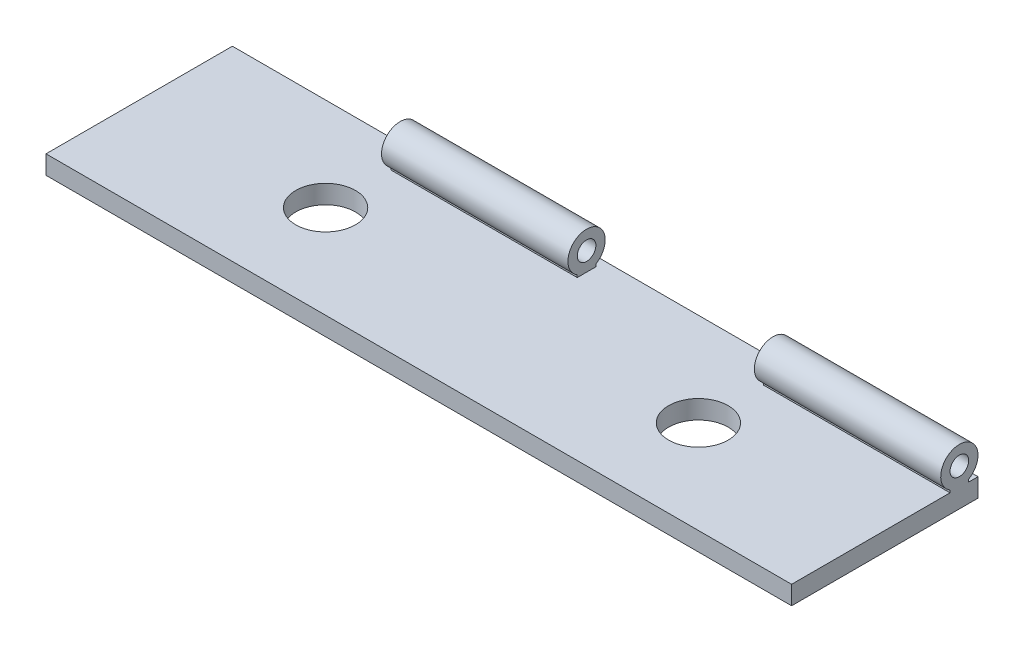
ISO-10303-21;
HEADER;
FILE_DESCRIPTION(('STEP AP214'),'2;1');
FILE_NAME('part.step','',(''),(''),'','','');
FILE_SCHEMA(('AUTOMOTIVE_DESIGN { 1 0 10303 214 1 1 1 1 }'));
ENDSEC;
DATA;
#1=APPLICATION_CONTEXT('core data for automotive mechanical design processes');
#2=APPLICATION_PROTOCOL_DEFINITION('international standard','automotive_design',2000,#1);
#3=PRODUCT_CONTEXT('',#1,'mechanical');
#4=PRODUCT('Part','Part','',(#3));
#5=PRODUCT_RELATED_PRODUCT_CATEGORY('part','',(#4));
#6=PRODUCT_DEFINITION_FORMATION('','',#4);
#7=PRODUCT_DEFINITION_CONTEXT('part definition',#1,'design');
#8=PRODUCT_DEFINITION('design','',#6,#7);
#9=PRODUCT_DEFINITION_SHAPE('','',#8);
#10=(LENGTH_UNIT() NAMED_UNIT(*) SI_UNIT(.MILLI.,.METRE.));
#11=(NAMED_UNIT(*) PLANE_ANGLE_UNIT() SI_UNIT($,.RADIAN.));
#12=(NAMED_UNIT(*) SI_UNIT($,.STERADIAN.) SOLID_ANGLE_UNIT());
#13=UNCERTAINTY_MEASURE_WITH_UNIT(LENGTH_MEASURE(1.E-05),#10,'distance_accuracy_value','');
#14=(GEOMETRIC_REPRESENTATION_CONTEXT(3) GLOBAL_UNCERTAINTY_ASSIGNED_CONTEXT((#13)) GLOBAL_UNIT_ASSIGNED_CONTEXT((#10,
#11,#12)) REPRESENTATION_CONTEXT('',''));
#15=CARTESIAN_POINT('',(0.,0.,0.));
#16=DIRECTION('',(0.,0.,1.));
#17=DIRECTION('',(1.,0.,0.));
#18=AXIS2_PLACEMENT_3D('',#15,#16,#17);
#19=CARTESIAN_POINT('',(0.,2.,-9.));
#20=DIRECTION('',(1.,0.,0.));
#21=DIRECTION('',(0.,0.,-1.));
#22=AXIS2_PLACEMENT_3D('',#19,#20,#21);
#23=CYLINDRICAL_SURFACE('',#22,0.999999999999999);
#24=DIRECTION('',(1.,0.,0.));
#25=VECTOR('',#24,1.);
#26=CARTESIAN_POINT('',(0.,1.13397459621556,-8.5));
#27=LINE('',#26,#25);
#28=CARTESIAN_POINT('',(10.,1.13397459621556,-8.5));
#29=VERTEX_POINT('',#28);
#30=CARTESIAN_POINT('',(20.,1.13397459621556,-8.5));
#31=VERTEX_POINT('',#30);
#32=EDGE_CURVE('E158',#29,#31,#27,.T.);
#33=ORIENTED_EDGE('',*,*,#32,.T.);
#34=CARTESIAN_POINT('',(20.,2.,-9.));
#35=DIRECTION('',(1.,0.,0.));
#36=DIRECTION('',(0.,0.,-1.));
#37=AXIS2_PLACEMENT_3D('',#34,#35,#36);
#38=CIRCLE('',#37,0.999999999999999);
#39=CARTESIAN_POINT('',(20.,1.13397459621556,-9.5));
#40=VERTEX_POINT('',#39);
#41=EDGE_CURVE('E140',#31,#40,#38,.F.);
#42=ORIENTED_EDGE('',*,*,#41,.T.);
#43=DIRECTION('',(1.,0.,0.));
#44=VECTOR('',#43,1.);
#45=CARTESIAN_POINT('',(0.,1.13397459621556,-9.5));
#46=LINE('',#45,#44);
#47=CARTESIAN_POINT('',(10.,1.13397459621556,-9.5));
#48=VERTEX_POINT('',#47);
#49=EDGE_CURVE('E138',#48,#40,#46,.T.);
#50=ORIENTED_EDGE('',*,*,#49,.F.);
#51=CARTESIAN_POINT('',(10.,2.,-9.));
#52=DIRECTION('',(-1.,0.,0.));
#53=DIRECTION('',(0.,0.,1.));
#54=AXIS2_PLACEMENT_3D('',#51,#52,#53);
#55=CIRCLE('',#54,0.999999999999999);
#56=EDGE_CURVE('E252',#48,#29,#55,.F.);
#57=ORIENTED_EDGE('',*,*,#56,.T.);
#58=EDGE_LOOP('',(#33,#42,#50,#57));
#59=FACE_BOUND('',#58,.T.);
#60=ADVANCED_FACE('F30',(#59),#23,.T.);
#61=CARTESIAN_POINT('',(30.,1.13397459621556,-9.5));
#62=VERTEX_POINT('',#61);
#63=CARTESIAN_POINT('',(40.,1.13397459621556,-9.5));
#64=VERTEX_POINT('',#63);
#65=EDGE_CURVE('E145',#62,#64,#46,.T.);
#66=ORIENTED_EDGE('',*,*,#65,.F.);
#67=CARTESIAN_POINT('',(30.,2.,-9.));
#68=DIRECTION('',(-1.,0.,0.));
#69=DIRECTION('',(0.,0.,1.));
#70=AXIS2_PLACEMENT_3D('',#67,#68,#69);
#71=CIRCLE('',#70,0.999999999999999);
#72=CARTESIAN_POINT('',(30.,1.13397459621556,-8.5));
#73=VERTEX_POINT('',#72);
#74=EDGE_CURVE('E325',#62,#73,#71,.F.);
#75=ORIENTED_EDGE('',*,*,#74,.T.);
#76=CARTESIAN_POINT('',(40.,1.13397459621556,-8.5));
#77=VERTEX_POINT('',#76);
#78=EDGE_CURVE('E162',#73,#77,#27,.T.);
#79=ORIENTED_EDGE('',*,*,#78,.T.);
#80=CARTESIAN_POINT('',(40.,2.,-9.));
#81=DIRECTION('',(1.,0.,0.));
#82=DIRECTION('',(0.,0.,-1.));
#83=AXIS2_PLACEMENT_3D('',#80,#81,#82);
#84=CIRCLE('',#83,0.999999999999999);
#85=EDGE_CURVE('E238',#64,#77,#84,.T.);
#86=ORIENTED_EDGE('',*,*,#85,.F.);
#87=EDGE_LOOP('',(#66,#75,#79,#86));
#88=FACE_BOUND('',#87,.T.);
#89=ADVANCED_FACE('F276',(#88),#23,.T.);
#90=CARTESIAN_POINT('',(0.,0.999999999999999,-9.5));
#91=DIRECTION('',(0.,0.,-1.));
#92=DIRECTION('',(-1.,0.,0.));
#93=AXIS2_PLACEMENT_3D('',#90,#91,#92);
#94=PLANE('',#93);
#95=ORIENTED_EDGE('',*,*,#49,.T.);
#96=DIRECTION('',(0.,-1.,0.));
#97=VECTOR('',#96,1.);
#98=CARTESIAN_POINT('',(20.,0.999999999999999,-9.5));
#99=LINE('',#98,#97);
#100=CARTESIAN_POINT('',(20.,1.,-9.5));
#101=VERTEX_POINT('',#100);
#102=EDGE_CURVE('E124',#40,#101,#99,.T.);
#103=ORIENTED_EDGE('',*,*,#102,.T.);
#104=DIRECTION('',(1.,0.,0.));
#105=VECTOR('',#104,1.);
#106=CARTESIAN_POINT('',(0.,0.999999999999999,-9.5));
#107=LINE('',#106,#105);
#108=CARTESIAN_POINT('',(10.,1.,-9.5));
#109=VERTEX_POINT('',#108);
#110=EDGE_CURVE('E136',#109,#101,#107,.T.);
#111=ORIENTED_EDGE('',*,*,#110,.F.);
#112=DIRECTION('',(0.,1.,0.));
#113=VECTOR('',#112,1.);
#114=CARTESIAN_POINT('',(10.,0.999999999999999,-9.5));
#115=LINE('',#114,#113);
#116=EDGE_CURVE('E259',#109,#48,#115,.T.);
#117=ORIENTED_EDGE('',*,*,#116,.T.);
#118=EDGE_LOOP('',(#95,#103,#111,#117));
#119=FACE_BOUND('',#118,.T.);
#120=ADVANCED_FACE('F134',(#119),#94,.T.);
#121=CARTESIAN_POINT('',(30.,1.,-9.5));
#122=VERTEX_POINT('',#121);
#123=CARTESIAN_POINT('',(40.,1.,-9.5));
#124=VERTEX_POINT('',#123);
#125=EDGE_CURVE('E34',#122,#124,#107,.T.);
#126=ORIENTED_EDGE('',*,*,#125,.F.);
#127=DIRECTION('',(0.,1.,0.));
#128=VECTOR('',#127,1.);
#129=CARTESIAN_POINT('',(30.,0.999999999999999,-9.5));
#130=LINE('',#129,#128);
#131=EDGE_CURVE('E321',#122,#62,#130,.T.);
#132=ORIENTED_EDGE('',*,*,#131,.T.);
#133=ORIENTED_EDGE('',*,*,#65,.T.);
#134=DIRECTION('',(0.,1.,0.));
#135=VECTOR('',#134,1.);
#136=CARTESIAN_POINT('',(40.,0.999999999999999,-9.5));
#137=LINE('',#136,#135);
#138=EDGE_CURVE('E236',#124,#64,#137,.T.);
#139=ORIENTED_EDGE('',*,*,#138,.F.);
#140=EDGE_LOOP('',(#126,#132,#133,#139));
#141=FACE_BOUND('',#140,.T.);
#142=ADVANCED_FACE('F312',(#141),#94,.T.);
#143=CARTESIAN_POINT('',(0.,0.999999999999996,-8.5));
#144=DIRECTION('',(0.,0.,1.));
#145=DIRECTION('',(1.,0.,0.));
#146=AXIS2_PLACEMENT_3D('',#143,#144,#145);
#147=PLANE('',#146);
#148=DIRECTION('',(1.,0.,0.));
#149=VECTOR('',#148,1.);
#150=CARTESIAN_POINT('',(0.,0.999999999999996,-8.5));
#151=LINE('',#150,#149);
#152=CARTESIAN_POINT('',(10.,1.,-8.5));
#153=VERTEX_POINT('',#152);
#154=CARTESIAN_POINT('',(20.,0.999999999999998,-8.5));
#155=VERTEX_POINT('',#154);
#156=EDGE_CURVE('E148',#153,#155,#151,.T.);
#157=ORIENTED_EDGE('',*,*,#156,.T.);
#158=DIRECTION('',(0.,1.,0.));
#159=VECTOR('',#158,1.);
#160=CARTESIAN_POINT('',(20.,0.999999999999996,-8.5));
#161=LINE('',#160,#159);
#162=EDGE_CURVE('E127',#155,#31,#161,.T.);
#163=ORIENTED_EDGE('',*,*,#162,.T.);
#164=ORIENTED_EDGE('',*,*,#32,.F.);
#165=DIRECTION('',(0.,-1.,0.));
#166=VECTOR('',#165,1.);
#167=CARTESIAN_POINT('',(10.,0.999999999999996,-8.5));
#168=LINE('',#167,#166);
#169=EDGE_CURVE('E248',#29,#153,#168,.T.);
#170=ORIENTED_EDGE('',*,*,#169,.T.);
#171=EDGE_LOOP('',(#157,#163,#164,#170));
#172=FACE_BOUND('',#171,.T.);
#173=ADVANCED_FACE('F285',(#172),#147,.T.);
#174=ORIENTED_EDGE('',*,*,#78,.F.);
#175=DIRECTION('',(0.,-1.,0.));
#176=VECTOR('',#175,1.);
#177=CARTESIAN_POINT('',(30.,0.999999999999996,-8.5));
#178=LINE('',#177,#176);
#179=CARTESIAN_POINT('',(30.,1.,-8.5));
#180=VERTEX_POINT('',#179);
#181=EDGE_CURVE('E339',#73,#180,#178,.T.);
#182=ORIENTED_EDGE('',*,*,#181,.T.);
#183=CARTESIAN_POINT('',(40.,0.999999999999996,-8.5));
#184=VERTEX_POINT('',#183);
#185=EDGE_CURVE('E152',#180,#184,#151,.T.);
#186=ORIENTED_EDGE('',*,*,#185,.T.);
#187=DIRECTION('',(0.,-1.,0.));
#188=VECTOR('',#187,1.);
#189=CARTESIAN_POINT('',(40.,0.999999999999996,-8.5));
#190=LINE('',#189,#188);
#191=EDGE_CURVE('E240',#77,#184,#190,.T.);
#192=ORIENTED_EDGE('',*,*,#191,.F.);
#193=EDGE_LOOP('',(#174,#182,#186,#192));
#194=FACE_BOUND('',#193,.T.);
#195=ADVANCED_FACE('F307',(#194),#147,.T.);
#196=CARTESIAN_POINT('',(0.,2.,-9.));
#197=DIRECTION('',(1.,0.,0.));
#198=DIRECTION('',(0.,0.,-1.));
#199=AXIS2_PLACEMENT_3D('',#196,#197,#198);
#200=CYLINDRICAL_SURFACE('',#199,0.500000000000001);
#201=CARTESIAN_POINT('',(10.,2.,-9.));
#202=DIRECTION('',(-1.,0.,0.));
#203=DIRECTION('',(0.,0.,1.));
#204=AXIS2_PLACEMENT_3D('',#201,#202,#203);
#205=CIRCLE('',#204,0.500000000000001);
#206=CARTESIAN_POINT('',(10.,2.,-8.5));
#207=VERTEX_POINT('',#206);
#208=EDGE_CURVE('E246',#207,#207,#205,.F.);
#209=ORIENTED_EDGE('',*,*,#208,.F.);
#210=EDGE_LOOP('',(#209));
#211=FACE_BOUND('',#210,.T.);
#212=CARTESIAN_POINT('',(20.,2.,-9.));
#213=DIRECTION('',(1.,0.,0.));
#214=DIRECTION('',(0.,0.,-1.));
#215=AXIS2_PLACEMENT_3D('',#212,#213,#214);
#216=CIRCLE('',#215,0.500000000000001);
#217=CARTESIAN_POINT('',(20.,2.,-9.5));
#218=VERTEX_POINT('',#217);
#219=EDGE_CURVE('E324',#218,#218,#216,.F.);
#220=ORIENTED_EDGE('',*,*,#219,.F.);
#221=EDGE_LOOP('',(#220));
#222=FACE_BOUND('',#221,.T.);
#223=ADVANCED_FACE('F302',(#211,#222),#200,.F.);
#224=CARTESIAN_POINT('',(40.,2.,-9.));
#225=DIRECTION('',(1.,0.,0.));
#226=DIRECTION('',(0.,0.,-1.));
#227=AXIS2_PLACEMENT_3D('',#224,#225,#226);
#228=CIRCLE('',#227,0.500000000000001);
#229=CARTESIAN_POINT('',(40.,2.,-9.5));
#230=VERTEX_POINT('',#229);
#231=EDGE_CURVE('E261',#230,#230,#228,.T.);
#232=ORIENTED_EDGE('',*,*,#231,.T.);
#233=EDGE_LOOP('',(#232));
#234=FACE_BOUND('',#233,.T.);
#235=CARTESIAN_POINT('',(30.,2.,-9.));
#236=DIRECTION('',(-1.,0.,0.));
#237=DIRECTION('',(0.,0.,1.));
#238=AXIS2_PLACEMENT_3D('',#235,#236,#237);
#239=CIRCLE('',#238,0.500000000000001);
#240=CARTESIAN_POINT('',(30.,2.,-8.5));
#241=VERTEX_POINT('',#240);
#242=EDGE_CURVE('E341',#241,#241,#239,.F.);
#243=ORIENTED_EDGE('',*,*,#242,.F.);
#244=EDGE_LOOP('',(#243));
#245=FACE_BOUND('',#244,.T.);
#246=ADVANCED_FACE('F265',(#234,#245),#200,.F.);
#247=CARTESIAN_POINT('',(0.,1.,-10.));
#248=DIRECTION('',(0.,-1.,0.));
#249=DIRECTION('',(0.,0.,-1.));
#250=AXIS2_PLACEMENT_3D('',#247,#248,#249);
#251=PLANE('',#250);
#252=ORIENTED_EDGE('',*,*,#110,.T.);
#253=DIRECTION('',(0.,0.,1.));
#254=VECTOR('',#253,1.);
#255=CARTESIAN_POINT('',(20.,1.,0.));
#256=LINE('',#255,#254);
#257=EDGE_CURVE('E48',#101,#155,#256,.T.);
#258=ORIENTED_EDGE('',*,*,#257,.T.);
#259=ORIENTED_EDGE('',*,*,#156,.F.);
#260=DIRECTION('',(0.,0.,-1.));
#261=VECTOR('',#260,1.);
#262=CARTESIAN_POINT('',(10.,1.,0.));
#263=LINE('',#262,#261);
#264=EDGE_CURVE('E139',#153,#109,#263,.T.);
#265=ORIENTED_EDGE('',*,*,#264,.T.);
#266=EDGE_LOOP('',(#252,#258,#259,#265));
#267=FACE_BOUND('',#266,.T.);
#268=CARTESIAN_POINT('',(30.,1.,-5.));
#269=DIRECTION('',(0.,1.,0.));
#270=DIRECTION('',(0.,0.,1.));
#271=AXIS2_PLACEMENT_3D('',#268,#269,#270);
#272=CIRCLE('',#271,1.6);
#273=CARTESIAN_POINT('',(30.,1.,-3.4));
#274=VERTEX_POINT('',#273);
#275=EDGE_CURVE('E172',#274,#274,#272,.T.);
#276=ORIENTED_EDGE('',*,*,#275,.F.);
#277=EDGE_LOOP('',(#276));
#278=FACE_BOUND('',#277,.T.);
#279=ORIENTED_EDGE('',*,*,#185,.F.);
#280=DIRECTION('',(0.,0.,-1.));
#281=VECTOR('',#280,1.);
#282=CARTESIAN_POINT('',(30.,1.,0.));
#283=LINE('',#282,#281);
#284=EDGE_CURVE('E129',#180,#122,#283,.T.);
#285=ORIENTED_EDGE('',*,*,#284,.T.);
#286=ORIENTED_EDGE('',*,*,#125,.T.);
#287=DIRECTION('',(0.,0.,-1.));
#288=VECTOR('',#287,1.);
#289=CARTESIAN_POINT('',(40.,1.,0.));
#290=LINE('',#289,#288);
#291=CARTESIAN_POINT('',(40.,1.,-10.));
#292=VERTEX_POINT('',#291);
#293=EDGE_CURVE('E196',#124,#292,#290,.T.);
#294=ORIENTED_EDGE('',*,*,#293,.T.);
#295=DIRECTION('',(-1.,0.,0.));
#296=VECTOR('',#295,1.);
#297=CARTESIAN_POINT('',(0.,1.,-10.));
#298=LINE('',#297,#296);
#299=CARTESIAN_POINT('',(0.,1.,-10.));
#300=VERTEX_POINT('',#299);
#301=EDGE_CURVE('E195',#292,#300,#298,.T.);
#302=ORIENTED_EDGE('',*,*,#301,.T.);
#303=DIRECTION('',(0.,0.,1.));
#304=VECTOR('',#303,1.);
#305=CARTESIAN_POINT('',(0.,1.,0.));
#306=LINE('',#305,#304);
#307=CARTESIAN_POINT('',(0.,1.,0.));
#308=VERTEX_POINT('',#307);
#309=EDGE_CURVE('E184',#300,#308,#306,.T.);
#310=ORIENTED_EDGE('',*,*,#309,.T.);
#311=DIRECTION('',(1.,0.,0.));
#312=VECTOR('',#311,1.);
#313=CARTESIAN_POINT('',(0.,1.,0.));
#314=LINE('',#313,#312);
#315=CARTESIAN_POINT('',(40.,1.,0.));
#316=VERTEX_POINT('',#315);
#317=EDGE_CURVE('E187',#308,#316,#314,.T.);
#318=ORIENTED_EDGE('',*,*,#317,.T.);
#319=EDGE_CURVE('E192',#316,#184,#290,.T.);
#320=ORIENTED_EDGE('',*,*,#319,.T.);
#321=EDGE_LOOP('',(#279,#285,#286,#294,#302,#310,#318,#320));
#322=FACE_BOUND('',#321,.T.);
#323=CARTESIAN_POINT('',(10.,1.,-5.));
#324=DIRECTION('',(0.,1.,0.));
#325=DIRECTION('',(0.,0.,1.));
#326=AXIS2_PLACEMENT_3D('',#323,#324,#325);
#327=CIRCLE('',#326,1.6);
#328=CARTESIAN_POINT('',(10.,1.,-3.4));
#329=VERTEX_POINT('',#328);
#330=EDGE_CURVE('E166',#329,#329,#327,.T.);
#331=ORIENTED_EDGE('',*,*,#330,.F.);
#332=EDGE_LOOP('',(#331));
#333=FACE_BOUND('',#332,.T.);
#334=ADVANCED_FACE('F143',(#267,#278,#322,#333),#251,.F.);
#335=CARTESIAN_POINT('',(0.,0.,-10.));
#336=DIRECTION('',(0.,-1.,0.));
#337=DIRECTION('',(0.,0.,-1.));
#338=AXIS2_PLACEMENT_3D('',#335,#336,#337);
#339=PLANE('',#338);
#340=CARTESIAN_POINT('',(30.,0.,-5.));
#341=DIRECTION('',(0.,1.,0.));
#342=DIRECTION('',(0.,0.,1.));
#343=AXIS2_PLACEMENT_3D('',#340,#341,#342);
#344=CIRCLE('',#343,1.6);
#345=CARTESIAN_POINT('',(30.,0.,-3.4));
#346=VERTEX_POINT('',#345);
#347=EDGE_CURVE('E169',#346,#346,#344,.T.);
#348=ORIENTED_EDGE('',*,*,#347,.T.);
#349=EDGE_LOOP('',(#348));
#350=FACE_BOUND('',#349,.T.);
#351=DIRECTION('',(0.,0.,1.));
#352=VECTOR('',#351,1.);
#353=CARTESIAN_POINT('',(0.,0.,0.));
#354=LINE('',#353,#352);
#355=CARTESIAN_POINT('',(0.,0.,-10.));
#356=VERTEX_POINT('',#355);
#357=CARTESIAN_POINT('',(0.,0.,0.));
#358=VERTEX_POINT('',#357);
#359=EDGE_CURVE('E175',#356,#358,#354,.T.);
#360=ORIENTED_EDGE('',*,*,#359,.F.);
#361=DIRECTION('',(-1.,0.,0.));
#362=VECTOR('',#361,1.);
#363=CARTESIAN_POINT('',(0.,0.,-10.));
#364=LINE('',#363,#362);
#365=CARTESIAN_POINT('',(40.,0.,-10.));
#366=VERTEX_POINT('',#365);
#367=EDGE_CURVE('E182',#366,#356,#364,.T.);
#368=ORIENTED_EDGE('',*,*,#367,.F.);
#369=DIRECTION('',(0.,0.,-1.));
#370=VECTOR('',#369,1.);
#371=CARTESIAN_POINT('',(40.,0.,0.));
#372=LINE('',#371,#370);
#373=CARTESIAN_POINT('',(40.,0.,0.));
#374=VERTEX_POINT('',#373);
#375=EDGE_CURVE('E180',#374,#366,#372,.T.);
#376=ORIENTED_EDGE('',*,*,#375,.F.);
#377=DIRECTION('',(1.,0.,0.));
#378=VECTOR('',#377,1.);
#379=CARTESIAN_POINT('',(0.,0.,0.));
#380=LINE('',#379,#378);
#381=EDGE_CURVE('E178',#358,#374,#380,.T.);
#382=ORIENTED_EDGE('',*,*,#381,.F.);
#383=EDGE_LOOP('',(#360,#368,#376,#382));
#384=FACE_BOUND('',#383,.T.);
#385=CARTESIAN_POINT('',(10.,0.,-5.));
#386=DIRECTION('',(0.,1.,0.));
#387=DIRECTION('',(0.,0.,1.));
#388=AXIS2_PLACEMENT_3D('',#385,#386,#387);
#389=CIRCLE('',#388,1.6);
#390=CARTESIAN_POINT('',(10.,0.,-3.4));
#391=VERTEX_POINT('',#390);
#392=EDGE_CURVE('E163',#391,#391,#389,.T.);
#393=ORIENTED_EDGE('',*,*,#392,.T.);
#394=EDGE_LOOP('',(#393));
#395=FACE_BOUND('',#394,.T.);
#396=ADVANCED_FACE('F221',(#350,#384,#395),#339,.T.);
#397=CARTESIAN_POINT('',(0.,1.,0.));
#398=DIRECTION('',(1.,0.,0.));
#399=DIRECTION('',(0.,0.,-1.));
#400=AXIS2_PLACEMENT_3D('',#397,#398,#399);
#401=PLANE('',#400);
#402=DIRECTION('',(0.,-1.,0.));
#403=VECTOR('',#402,1.);
#404=CARTESIAN_POINT('',(0.,1.,0.));
#405=LINE('',#404,#403);
#406=EDGE_CURVE('E11',#308,#358,#405,.T.);
#407=ORIENTED_EDGE('',*,*,#406,.F.);
#408=ORIENTED_EDGE('',*,*,#309,.F.);
#409=DIRECTION('',(0.,-1.,0.));
#410=VECTOR('',#409,1.);
#411=CARTESIAN_POINT('',(0.,1.,-10.));
#412=LINE('',#411,#410);
#413=EDGE_CURVE('E202',#300,#356,#412,.T.);
#414=ORIENTED_EDGE('',*,*,#413,.T.);
#415=ORIENTED_EDGE('',*,*,#359,.T.);
#416=EDGE_LOOP('',(#407,#408,#414,#415));
#417=FACE_BOUND('',#416,.T.);
#418=ADVANCED_FACE('F32',(#417),#401,.F.);
#419=CARTESIAN_POINT('',(0.,1.,0.));
#420=DIRECTION('',(0.,0.,-1.));
#421=DIRECTION('',(-1.,0.,0.));
#422=AXIS2_PLACEMENT_3D('',#419,#420,#421);
#423=PLANE('',#422);
#424=ORIENTED_EDGE('',*,*,#381,.T.);
#425=DIRECTION('',(0.,-1.,0.));
#426=VECTOR('',#425,1.);
#427=CARTESIAN_POINT('',(40.,1.,0.));
#428=LINE('',#427,#426);
#429=EDGE_CURVE('E40',#316,#374,#428,.T.);
#430=ORIENTED_EDGE('',*,*,#429,.F.);
#431=ORIENTED_EDGE('',*,*,#317,.F.);
#432=ORIENTED_EDGE('',*,*,#406,.T.);
#433=EDGE_LOOP('',(#424,#430,#431,#432));
#434=FACE_BOUND('',#433,.T.);
#435=ADVANCED_FACE('F232',(#434),#423,.F.);
#436=CARTESIAN_POINT('',(40.,1.,0.));
#437=DIRECTION('',(-1.,0.,0.));
#438=DIRECTION('',(0.,0.,1.));
#439=AXIS2_PLACEMENT_3D('',#436,#437,#438);
#440=PLANE('',#439);
#441=ORIENTED_EDGE('',*,*,#375,.T.);
#442=DIRECTION('',(0.,-1.,0.));
#443=VECTOR('',#442,1.);
#444=CARTESIAN_POINT('',(40.,1.,-10.));
#445=LINE('',#444,#443);
#446=EDGE_CURVE('E205',#292,#366,#445,.T.);
#447=ORIENTED_EDGE('',*,*,#446,.F.);
#448=ORIENTED_EDGE('',*,*,#293,.F.);
#449=ORIENTED_EDGE('',*,*,#138,.T.);
#450=ORIENTED_EDGE('',*,*,#85,.T.);
#451=ORIENTED_EDGE('',*,*,#191,.T.);
#452=ORIENTED_EDGE('',*,*,#319,.F.);
#453=ORIENTED_EDGE('',*,*,#429,.T.);
#454=EDGE_LOOP('',(#441,#447,#448,#449,#450,#451,#452,#453));
#455=FACE_BOUND('',#454,.T.);
#456=ORIENTED_EDGE('',*,*,#231,.F.);
#457=EDGE_LOOP('',(#456));
#458=FACE_BOUND('',#457,.T.);
#459=ADVANCED_FACE('F212',(#455,#458),#440,.F.);
#460=CARTESIAN_POINT('',(0.,1.,-10.));
#461=DIRECTION('',(0.,0.,1.));
#462=DIRECTION('',(1.,0.,0.));
#463=AXIS2_PLACEMENT_3D('',#460,#461,#462);
#464=PLANE('',#463);
#465=ORIENTED_EDGE('',*,*,#367,.T.);
#466=ORIENTED_EDGE('',*,*,#413,.F.);
#467=ORIENTED_EDGE('',*,*,#301,.F.);
#468=ORIENTED_EDGE('',*,*,#446,.T.);
#469=EDGE_LOOP('',(#465,#466,#467,#468));
#470=FACE_BOUND('',#469,.T.);
#471=ADVANCED_FACE('F225',(#470),#464,.F.);
#472=CARTESIAN_POINT('',(30.,1.,-5.));
#473=DIRECTION('',(0.,-1.,0.));
#474=DIRECTION('',(0.,0.,-1.));
#475=AXIS2_PLACEMENT_3D('',#472,#473,#474);
#476=CYLINDRICAL_SURFACE('',#475,1.6);
#477=ORIENTED_EDGE('',*,*,#275,.T.);
#478=EDGE_LOOP('',(#477));
#479=FACE_BOUND('',#478,.T.);
#480=ORIENTED_EDGE('',*,*,#347,.F.);
#481=EDGE_LOOP('',(#480));
#482=FACE_BOUND('',#481,.T.);
#483=ADVANCED_FACE('F273',(#479,#482),#476,.F.);
#484=CARTESIAN_POINT('',(10.,1.,-5.));
#485=DIRECTION('',(0.,-1.,0.));
#486=DIRECTION('',(0.,0.,-1.));
#487=AXIS2_PLACEMENT_3D('',#484,#485,#486);
#488=CYLINDRICAL_SURFACE('',#487,1.6);
#489=ORIENTED_EDGE('',*,*,#330,.T.);
#490=EDGE_LOOP('',(#489));
#491=FACE_BOUND('',#490,.T.);
#492=ORIENTED_EDGE('',*,*,#392,.F.);
#493=EDGE_LOOP('',(#492));
#494=FACE_BOUND('',#493,.T.);
#495=ADVANCED_FACE('F287',(#491,#494),#488,.F.);
#496=CARTESIAN_POINT('',(10.,11.,0.));
#497=DIRECTION('',(-1.,0.,0.));
#498=DIRECTION('',(0.,0.,1.));
#499=AXIS2_PLACEMENT_3D('',#496,#497,#498);
#500=PLANE('',#499);
#501=ORIENTED_EDGE('',*,*,#264,.F.);
#502=ORIENTED_EDGE('',*,*,#169,.F.);
#503=ORIENTED_EDGE('',*,*,#56,.F.);
#504=ORIENTED_EDGE('',*,*,#116,.F.);
#505=EDGE_LOOP('',(#501,#502,#503,#504));
#506=FACE_BOUND('',#505,.T.);
#507=ORIENTED_EDGE('',*,*,#208,.T.);
#508=EDGE_LOOP('',(#507));
#509=FACE_BOUND('',#508,.T.);
#510=ADVANCED_FACE('F290',(#506,#509),#500,.T.);
#511=CARTESIAN_POINT('',(20.,11.,0.));
#512=DIRECTION('',(1.,0.,0.));
#513=DIRECTION('',(0.,0.,-1.));
#514=AXIS2_PLACEMENT_3D('',#511,#512,#513);
#515=PLANE('',#514);
#516=ORIENTED_EDGE('',*,*,#41,.F.);
#517=ORIENTED_EDGE('',*,*,#162,.F.);
#518=ORIENTED_EDGE('',*,*,#257,.F.);
#519=ORIENTED_EDGE('',*,*,#102,.F.);
#520=EDGE_LOOP('',(#516,#517,#518,#519));
#521=FACE_BOUND('',#520,.T.);
#522=ORIENTED_EDGE('',*,*,#219,.T.);
#523=EDGE_LOOP('',(#522));
#524=FACE_BOUND('',#523,.T.);
#525=ADVANCED_FACE('F122',(#521,#524),#515,.T.);
#526=CARTESIAN_POINT('',(30.,11.,0.));
#527=DIRECTION('',(-1.,0.,0.));
#528=DIRECTION('',(0.,0.,1.));
#529=AXIS2_PLACEMENT_3D('',#526,#527,#528);
#530=PLANE('',#529);
#531=ORIENTED_EDGE('',*,*,#284,.F.);
#532=ORIENTED_EDGE('',*,*,#181,.F.);
#533=ORIENTED_EDGE('',*,*,#74,.F.);
#534=ORIENTED_EDGE('',*,*,#131,.F.);
#535=EDGE_LOOP('',(#531,#532,#533,#534));
#536=FACE_BOUND('',#535,.T.);
#537=ORIENTED_EDGE('',*,*,#242,.T.);
#538=EDGE_LOOP('',(#537));
#539=FACE_BOUND('',#538,.T.);
#540=ADVANCED_FACE('F346',(#536,#539),#530,.T.);
#541=CLOSED_SHELL('',(#60,#89,#120,#142,#173,#195,#223,#246,#334,#396,#418,#435,#459,#471,#483,
#495,#510,#525,#540));
#542=MANIFOLD_SOLID_BREP('B2',#541);
#543=ADVANCED_BREP_SHAPE_REPRESENTATION('',(#18,#542),#14);
#544=SHAPE_DEFINITION_REPRESENTATION(#9,#543);
ENDSEC;
END-ISO-10303-21;
